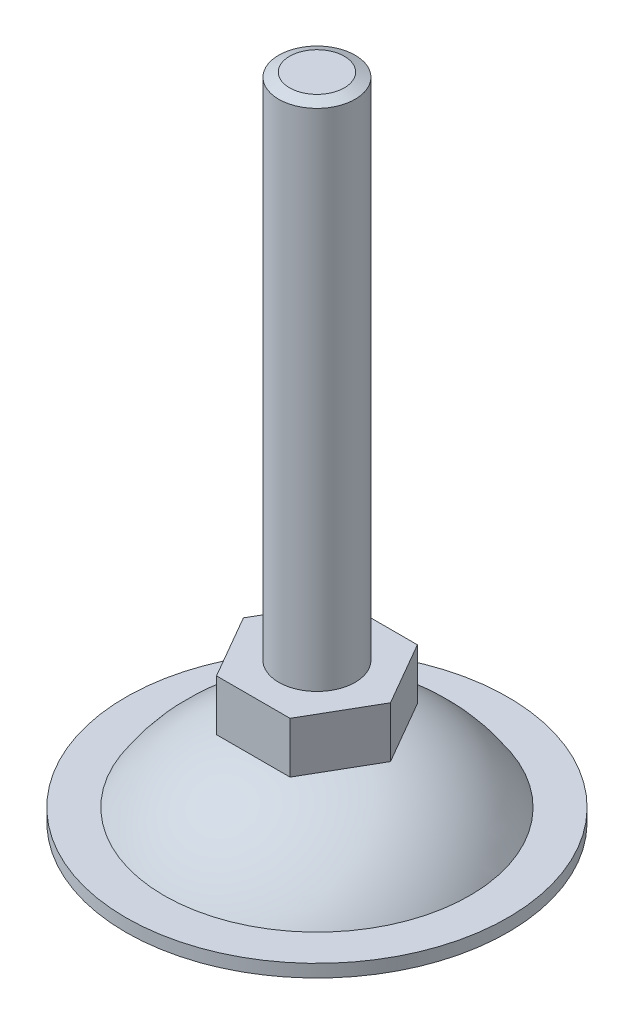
ISO-10303-21;
HEADER;
FILE_DESCRIPTION(('STEP AP214'),'2;1');
FILE_NAME('part.step','',(''),(''),'','','');
FILE_SCHEMA(('AUTOMOTIVE_DESIGN { 1 0 10303 214 1 1 1 1 }'));
ENDSEC;
DATA;
#1=APPLICATION_CONTEXT('core data for automotive mechanical design processes');
#2=APPLICATION_PROTOCOL_DEFINITION('international standard','automotive_design',2000,#1);
#3=PRODUCT_CONTEXT('',#1,'mechanical');
#4=PRODUCT('Part','Part','',(#3));
#5=PRODUCT_RELATED_PRODUCT_CATEGORY('part','',(#4));
#6=PRODUCT_DEFINITION_FORMATION('','',#4);
#7=PRODUCT_DEFINITION_CONTEXT('part definition',#1,'design');
#8=PRODUCT_DEFINITION('design','',#6,#7);
#9=PRODUCT_DEFINITION_SHAPE('','',#8);
#10=(LENGTH_UNIT() NAMED_UNIT(*) SI_UNIT(.MILLI.,.METRE.));
#11=(NAMED_UNIT(*) PLANE_ANGLE_UNIT() SI_UNIT($,.RADIAN.));
#12=(NAMED_UNIT(*) SI_UNIT($,.STERADIAN.) SOLID_ANGLE_UNIT());
#13=UNCERTAINTY_MEASURE_WITH_UNIT(LENGTH_MEASURE(1.E-05),#10,'distance_accuracy_value','');
#14=(GEOMETRIC_REPRESENTATION_CONTEXT(3) GLOBAL_UNCERTAINTY_ASSIGNED_CONTEXT((#13)) GLOBAL_UNIT_ASSIGNED_CONTEXT((#10,
#11,#12)) REPRESENTATION_CONTEXT('',''));
#15=CARTESIAN_POINT('',(0.,0.,0.));
#16=DIRECTION('',(0.,0.,1.));
#17=DIRECTION('',(1.,0.,0.));
#18=AXIS2_PLACEMENT_3D('',#15,#16,#17);
#19=CARTESIAN_POINT('',(0.,51.,0.));
#20=DIRECTION('',(0.,1.,0.));
#21=DIRECTION('',(0.,0.,1.));
#22=AXIS2_PLACEMENT_3D('',#19,#20,#21);
#23=CYLINDRICAL_SURFACE('',#22,3.);
#24=CARTESIAN_POINT('',(0.,6.90262048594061,0.));
#25=DIRECTION('',(0.,1.,0.));
#26=DIRECTION('',(0.,0.,1.));
#27=AXIS2_PLACEMENT_3D('',#24,#25,#26);
#28=CIRCLE('',#27,3.00000000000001);
#29=CARTESIAN_POINT('',(0.,6.90262048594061,3.00000000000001));
#30=VERTEX_POINT('',#29);
#31=EDGE_CURVE('E155',#30,#30,#28,.T.);
#32=ORIENTED_EDGE('',*,*,#31,.T.);
#33=EDGE_LOOP('',(#32));
#34=FACE_BOUND('',#33,.T.);
#35=CARTESIAN_POINT('',(0.,6.99999999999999,0.));
#36=DIRECTION('',(0.,1.,0.));
#37=DIRECTION('',(0.,0.,1.));
#38=AXIS2_PLACEMENT_3D('',#35,#36,#37);
#39=CIRCLE('',#38,3.);
#40=CARTESIAN_POINT('',(0.,6.99999999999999,3.));
#41=VERTEX_POINT('',#40);
#42=EDGE_CURVE('E11',#41,#41,#39,.T.);
#43=ORIENTED_EDGE('',*,*,#42,.F.);
#44=EDGE_LOOP('',(#43));
#45=FACE_BOUND('',#44,.T.);
#46=ADVANCED_FACE('F37',(#34,#45),#23,.T.);
#47=CARTESIAN_POINT('',(0.,0.,0.));
#48=DIRECTION('',(0.,1.,0.));
#49=DIRECTION('',(0.,0.,1.));
#50=AXIS2_PLACEMENT_3D('',#47,#48,#49);
#51=PLANE('',#50);
#52=CARTESIAN_POINT('',(0.,0.,0.));
#53=DIRECTION('',(0.,1.,0.));
#54=DIRECTION('',(0.,0.,1.));
#55=AXIS2_PLACEMENT_3D('',#52,#53,#54);
#56=CIRCLE('',#55,15.);
#57=CARTESIAN_POINT('',(0.,0.,15.));
#58=VERTEX_POINT('',#57);
#59=EDGE_CURVE('E47',#58,#58,#56,.T.);
#60=ORIENTED_EDGE('',*,*,#59,.F.);
#61=EDGE_LOOP('',(#60));
#62=FACE_BOUND('',#61,.T.);
#63=ADVANCED_FACE('F169',(#62),#51,.F.);
#64=CARTESIAN_POINT('',(0.,51.,0.));
#65=DIRECTION('',(0.,1.,0.));
#66=DIRECTION('',(0.,0.,1.));
#67=AXIS2_PLACEMENT_3D('',#64,#65,#66);
#68=CYLINDRICAL_SURFACE('',#67,15.);
#69=CARTESIAN_POINT('',(0.,0.999999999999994,0.));
#70=DIRECTION('',(0.,1.,0.));
#71=DIRECTION('',(0.,0.,1.));
#72=AXIS2_PLACEMENT_3D('',#69,#70,#71);
#73=CIRCLE('',#72,15.);
#74=CARTESIAN_POINT('',(0.,0.999999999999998,15.));
#75=VERTEX_POINT('',#74);
#76=EDGE_CURVE('E161',#75,#75,#73,.T.);
#77=ORIENTED_EDGE('',*,*,#76,.F.);
#78=EDGE_LOOP('',(#77));
#79=FACE_BOUND('',#78,.T.);
#80=ORIENTED_EDGE('',*,*,#59,.T.);
#81=EDGE_LOOP('',(#80));
#82=FACE_BOUND('',#81,.T.);
#83=ADVANCED_FACE('F167',(#79,#82),#68,.T.);
#84=CARTESIAN_POINT('',(0.,1.00000000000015,-12.));
#85=DIRECTION('',(0.,-1.,0.));
#86=DIRECTION('',(0.,0.,-1.));
#87=AXIS2_PLACEMENT_3D('',#84,#85,#86);
#88=PLANE('',#87);
#89=CARTESIAN_POINT('',(0.,1.00000000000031,0.));
#90=DIRECTION('',(0.,1.,0.));
#91=DIRECTION('',(0.,0.,1.));
#92=AXIS2_PLACEMENT_3D('',#89,#90,#91);
#93=CIRCLE('',#92,12.);
#94=CARTESIAN_POINT('',(0.,1.00000000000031,12.));
#95=VERTEX_POINT('',#94);
#96=EDGE_CURVE('E158',#95,#95,#93,.T.);
#97=ORIENTED_EDGE('',*,*,#96,.F.);
#98=EDGE_LOOP('',(#97));
#99=FACE_BOUND('',#98,.T.);
#100=ORIENTED_EDGE('',*,*,#76,.T.);
#101=EDGE_LOOP('',(#100));
#102=FACE_BOUND('',#101,.T.);
#103=ADVANCED_FACE('F175',(#99,#102),#88,.F.);
#104=CARTESIAN_POINT('',(0.,-5.82974175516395,0.));
#105=DIRECTION('',(0.,1.,0.));
#106=DIRECTION('',(0.,0.,1.));
#107=AXIS2_PLACEMENT_3D('',#104,#105,#106);
#108=DEGENERATE_TOROIDAL_SURFACE('',#107,1.08512912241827,12.8755496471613,.T.);
#109=ORIENTED_EDGE('',*,*,#31,.F.);
#110=EDGE_LOOP('',(#109));
#111=FACE_BOUND('',#110,.T.);
#112=ORIENTED_EDGE('',*,*,#96,.T.);
#113=EDGE_LOOP('',(#112));
#114=FACE_BOUND('',#113,.T.);
#115=ADVANCED_FACE('F184',(#111,#114),#108,.T.);
#116=CARTESIAN_POINT('',(2.88675134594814,11.,-5.00000000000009));
#117=DIRECTION('',(0.,1.,0.));
#118=DIRECTION('',(0.,0.,1.));
#119=AXIS2_PLACEMENT_3D('',#116,#117,#118);
#120=PLANE('',#119);
#121=DIRECTION('',(1.,0.,0.));
#122=VECTOR('',#121,1.);
#123=CARTESIAN_POINT('',(2.88675134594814,11.,-5.00000000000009));
#124=LINE('',#123,#122);
#125=CARTESIAN_POINT('',(-2.88675134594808,11.,-5.00000000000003));
#126=VERTEX_POINT('',#125);
#127=CARTESIAN_POINT('',(2.88675134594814,11.,-5.00000000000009));
#128=VERTEX_POINT('',#127);
#129=EDGE_CURVE('E142',#126,#128,#124,.T.);
#130=ORIENTED_EDGE('',*,*,#129,.F.);
#131=DIRECTION('',(0.500000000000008,0.,-0.866025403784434));
#132=VECTOR('',#131,1.);
#133=CARTESIAN_POINT('',(-2.88675134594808,11.,-5.00000000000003));
#134=LINE('',#133,#132);
#135=CARTESIAN_POINT('',(-5.77350269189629,11.,0.));
#136=VERTEX_POINT('',#135);
#137=EDGE_CURVE('E117',#136,#126,#134,.T.);
#138=ORIENTED_EDGE('',*,*,#137,.F.);
#139=DIRECTION('',(-0.500000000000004,0.,-0.866025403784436));
#140=VECTOR('',#139,1.);
#141=CARTESIAN_POINT('',(-5.77350269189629,11.,0.));
#142=LINE('',#141,#140);
#143=CARTESIAN_POINT('',(-2.88675134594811,11.,5.00000000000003));
#144=VERTEX_POINT('',#143);
#145=EDGE_CURVE('E101',#144,#136,#142,.T.);
#146=ORIENTED_EDGE('',*,*,#145,.F.);
#147=DIRECTION('',(-1.,0.,0.));
#148=VECTOR('',#147,1.);
#149=CARTESIAN_POINT('',(2.88675134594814,11.,5.00000000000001));
#150=LINE('',#149,#148);
#151=CARTESIAN_POINT('',(2.88675134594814,11.,5.00000000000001));
#152=VERTEX_POINT('',#151);
#153=EDGE_CURVE('E115',#152,#144,#150,.T.);
#154=ORIENTED_EDGE('',*,*,#153,.F.);
#155=DIRECTION('',(-0.499999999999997,0.,0.86602540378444));
#156=VECTOR('',#155,1.);
#157=CARTESIAN_POINT('',(5.77350269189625,11.,0.));
#158=LINE('',#157,#156);
#159=CARTESIAN_POINT('',(5.77350269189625,11.,0.));
#160=VERTEX_POINT('',#159);
#161=EDGE_CURVE('E120',#160,#152,#158,.T.);
#162=ORIENTED_EDGE('',*,*,#161,.F.);
#163=DIRECTION('',(0.499999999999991,0.,0.866025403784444));
#164=VECTOR('',#163,1.);
#165=CARTESIAN_POINT('',(2.88675134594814,11.,-5.00000000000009));
#166=LINE('',#165,#164);
#167=EDGE_CURVE('E122',#128,#160,#166,.T.);
#168=ORIENTED_EDGE('',*,*,#167,.F.);
#169=EDGE_LOOP('',(#130,#138,#146,#154,#162,#168));
#170=FACE_BOUND('',#169,.T.);
#171=CARTESIAN_POINT('',(0.,11.,0.));
#172=DIRECTION('',(0.,1.,0.));
#173=DIRECTION('',(0.,0.,1.));
#174=AXIS2_PLACEMENT_3D('',#171,#172,#173);
#175=CIRCLE('',#174,3.);
#176=CARTESIAN_POINT('',(0.,11.,3.));
#177=VERTEX_POINT('',#176);
#178=EDGE_CURVE('E41',#177,#177,#175,.T.);
#179=ORIENTED_EDGE('',*,*,#178,.F.);
#180=EDGE_LOOP('',(#179));
#181=FACE_BOUND('',#180,.T.);
#182=ADVANCED_FACE('F112',(#170,#181),#120,.T.);
#183=CARTESIAN_POINT('',(2.88675134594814,7.,-5.00000000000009));
#184=DIRECTION('',(0.,1.,0.));
#185=DIRECTION('',(0.,0.,1.));
#186=AXIS2_PLACEMENT_3D('',#183,#184,#185);
#187=PLANE('',#186);
#188=DIRECTION('',(1.,0.,0.));
#189=VECTOR('',#188,1.);
#190=CARTESIAN_POINT('',(2.88675134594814,7.,-5.00000000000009));
#191=LINE('',#190,#189);
#192=CARTESIAN_POINT('',(-2.88675134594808,7.,-5.00000000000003));
#193=VERTEX_POINT('',#192);
#194=CARTESIAN_POINT('',(2.88675134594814,7.,-5.00000000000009));
#195=VERTEX_POINT('',#194);
#196=EDGE_CURVE('E127',#193,#195,#191,.T.);
#197=ORIENTED_EDGE('',*,*,#196,.T.);
#198=DIRECTION('',(0.499999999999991,0.,0.866025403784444));
#199=VECTOR('',#198,1.);
#200=CARTESIAN_POINT('',(2.88675134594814,7.,-5.00000000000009));
#201=LINE('',#200,#199);
#202=CARTESIAN_POINT('',(5.77350269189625,6.99999999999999,0.));
#203=VERTEX_POINT('',#202);
#204=EDGE_CURVE('E130',#195,#203,#201,.T.);
#205=ORIENTED_EDGE('',*,*,#204,.T.);
#206=DIRECTION('',(-0.499999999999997,0.,0.86602540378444));
#207=VECTOR('',#206,1.);
#208=CARTESIAN_POINT('',(5.77350269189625,6.99999999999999,0.));
#209=LINE('',#208,#207);
#210=CARTESIAN_POINT('',(2.88675134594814,6.99999999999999,5.));
#211=VERTEX_POINT('',#210);
#212=EDGE_CURVE('E133',#203,#211,#209,.T.);
#213=ORIENTED_EDGE('',*,*,#212,.T.);
#214=DIRECTION('',(-1.,0.,0.));
#215=VECTOR('',#214,1.);
#216=CARTESIAN_POINT('',(2.88675134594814,6.99999999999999,5.));
#217=LINE('',#216,#215);
#218=CARTESIAN_POINT('',(-2.88675134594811,6.99999999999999,5.00000000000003));
#219=VERTEX_POINT('',#218);
#220=EDGE_CURVE('E136',#211,#219,#217,.T.);
#221=ORIENTED_EDGE('',*,*,#220,.T.);
#222=DIRECTION('',(-0.500000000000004,0.,-0.866025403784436));
#223=VECTOR('',#222,1.);
#224=CARTESIAN_POINT('',(-5.77350269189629,6.99999999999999,0.));
#225=LINE('',#224,#223);
#226=CARTESIAN_POINT('',(-5.77350269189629,6.99999999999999,0.));
#227=VERTEX_POINT('',#226);
#228=EDGE_CURVE('E103',#219,#227,#225,.T.);
#229=ORIENTED_EDGE('',*,*,#228,.T.);
#230=DIRECTION('',(0.500000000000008,0.,-0.866025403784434));
#231=VECTOR('',#230,1.);
#232=CARTESIAN_POINT('',(-2.88675134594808,7.,-5.00000000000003));
#233=LINE('',#232,#231);
#234=EDGE_CURVE('E139',#227,#193,#233,.T.);
#235=ORIENTED_EDGE('',*,*,#234,.T.);
#236=EDGE_LOOP('',(#197,#205,#213,#221,#229,#235));
#237=FACE_BOUND('',#236,.T.);
#238=ORIENTED_EDGE('',*,*,#42,.T.);
#239=EDGE_LOOP('',(#238));
#240=FACE_BOUND('',#239,.T.);
#241=ADVANCED_FACE('F199',(#237,#240),#187,.F.);
#242=CARTESIAN_POINT('',(2.88675134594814,11.,-5.00000000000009));
#243=DIRECTION('',(0.,0.,-1.));
#244=DIRECTION('',(-1.,0.,0.));
#245=AXIS2_PLACEMENT_3D('',#242,#243,#244);
#246=PLANE('',#245);
#247=ORIENTED_EDGE('',*,*,#196,.F.);
#248=DIRECTION('',(0.,-1.,0.));
#249=VECTOR('',#248,1.);
#250=CARTESIAN_POINT('',(-2.88675134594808,11.,-5.00000000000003));
#251=LINE('',#250,#249);
#252=EDGE_CURVE('E55',#126,#193,#251,.T.);
#253=ORIENTED_EDGE('',*,*,#252,.F.);
#254=ORIENTED_EDGE('',*,*,#129,.T.);
#255=DIRECTION('',(0.,-1.,0.));
#256=VECTOR('',#255,1.);
#257=CARTESIAN_POINT('',(2.88675134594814,11.,-5.00000000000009));
#258=LINE('',#257,#256);
#259=EDGE_CURVE('E90',#128,#195,#258,.T.);
#260=ORIENTED_EDGE('',*,*,#259,.T.);
#261=EDGE_LOOP('',(#247,#253,#254,#260));
#262=FACE_BOUND('',#261,.T.);
#263=ADVANCED_FACE('F195',(#262),#246,.T.);
#264=CARTESIAN_POINT('',(-2.88675134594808,11.,-5.00000000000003));
#265=DIRECTION('',(-0.866025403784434,0.,-0.500000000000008));
#266=DIRECTION('',(-0.500000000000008,0.,0.866025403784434));
#267=AXIS2_PLACEMENT_3D('',#264,#265,#266);
#268=PLANE('',#267);
#269=ORIENTED_EDGE('',*,*,#234,.F.);
#270=DIRECTION('',(0.,-1.,0.));
#271=VECTOR('',#270,1.);
#272=CARTESIAN_POINT('',(-5.77350269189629,11.,0.));
#273=LINE('',#272,#271);
#274=EDGE_CURVE('E78',#136,#227,#273,.T.);
#275=ORIENTED_EDGE('',*,*,#274,.F.);
#276=ORIENTED_EDGE('',*,*,#137,.T.);
#277=ORIENTED_EDGE('',*,*,#252,.T.);
#278=EDGE_LOOP('',(#269,#275,#276,#277));
#279=FACE_BOUND('',#278,.T.);
#280=ADVANCED_FACE('F198',(#279),#268,.T.);
#281=CARTESIAN_POINT('',(-5.77350269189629,11.,0.));
#282=DIRECTION('',(-0.866025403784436,0.,0.500000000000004));
#283=DIRECTION('',(0.500000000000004,0.,0.866025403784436));
#284=AXIS2_PLACEMENT_3D('',#281,#282,#283);
#285=PLANE('',#284);
#286=ORIENTED_EDGE('',*,*,#228,.F.);
#287=DIRECTION('',(0.,-1.,0.));
#288=VECTOR('',#287,1.);
#289=CARTESIAN_POINT('',(-2.88675134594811,11.,5.00000000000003));
#290=LINE('',#289,#288);
#291=EDGE_CURVE('E98',#144,#219,#290,.T.);
#292=ORIENTED_EDGE('',*,*,#291,.F.);
#293=ORIENTED_EDGE('',*,*,#145,.T.);
#294=ORIENTED_EDGE('',*,*,#274,.T.);
#295=EDGE_LOOP('',(#286,#292,#293,#294));
#296=FACE_BOUND('',#295,.T.);
#297=ADVANCED_FACE('F100',(#296),#285,.T.);
#298=CARTESIAN_POINT('',(2.88675134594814,11.,5.00000000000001));
#299=DIRECTION('',(0.,0.,1.));
#300=DIRECTION('',(1.,0.,0.));
#301=AXIS2_PLACEMENT_3D('',#298,#299,#300);
#302=PLANE('',#301);
#303=ORIENTED_EDGE('',*,*,#220,.F.);
#304=DIRECTION('',(0.,-1.,0.));
#305=VECTOR('',#304,1.);
#306=CARTESIAN_POINT('',(2.88675134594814,11.,5.00000000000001));
#307=LINE('',#306,#305);
#308=EDGE_CURVE('E108',#152,#211,#307,.T.);
#309=ORIENTED_EDGE('',*,*,#308,.F.);
#310=ORIENTED_EDGE('',*,*,#153,.T.);
#311=ORIENTED_EDGE('',*,*,#291,.T.);
#312=EDGE_LOOP('',(#303,#309,#310,#311));
#313=FACE_BOUND('',#312,.T.);
#314=ADVANCED_FACE('F119',(#313),#302,.T.);
#315=CARTESIAN_POINT('',(5.77350269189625,11.,0.));
#316=DIRECTION('',(0.86602540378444,0.,0.499999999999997));
#317=DIRECTION('',(0.499999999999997,0.,-0.86602540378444));
#318=AXIS2_PLACEMENT_3D('',#315,#316,#317);
#319=PLANE('',#318);
#320=ORIENTED_EDGE('',*,*,#212,.F.);
#321=DIRECTION('',(0.,-1.,0.));
#322=VECTOR('',#321,1.);
#323=CARTESIAN_POINT('',(5.77350269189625,11.,0.));
#324=LINE('',#323,#322);
#325=EDGE_CURVE('E146',#160,#203,#324,.T.);
#326=ORIENTED_EDGE('',*,*,#325,.F.);
#327=ORIENTED_EDGE('',*,*,#161,.T.);
#328=ORIENTED_EDGE('',*,*,#308,.T.);
#329=EDGE_LOOP('',(#320,#326,#327,#328));
#330=FACE_BOUND('',#329,.T.);
#331=ADVANCED_FACE('F203',(#330),#319,.T.);
#332=CARTESIAN_POINT('',(2.88675134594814,11.,-5.00000000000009));
#333=DIRECTION('',(0.866025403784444,0.,-0.499999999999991));
#334=DIRECTION('',(-0.499999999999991,0.,-0.866025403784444));
#335=AXIS2_PLACEMENT_3D('',#332,#333,#334);
#336=PLANE('',#335);
#337=ORIENTED_EDGE('',*,*,#204,.F.);
#338=ORIENTED_EDGE('',*,*,#259,.F.);
#339=ORIENTED_EDGE('',*,*,#167,.T.);
#340=ORIENTED_EDGE('',*,*,#325,.T.);
#341=EDGE_LOOP('',(#337,#338,#339,#340));
#342=FACE_BOUND('',#341,.T.);
#343=ADVANCED_FACE('F200',(#342),#336,.T.);
#344=CARTESIAN_POINT('',(0.,51.,0.));
#345=DIRECTION('',(0.,-1.,0.));
#346=DIRECTION('',(0.,0.,-1.));
#347=AXIS2_PLACEMENT_3D('',#344,#345,#346);
#348=PLANE('',#347);
#349=CARTESIAN_POINT('',(0.,51.,0.));
#350=DIRECTION('',(0.,1.,0.));
#351=DIRECTION('',(0.,0.,1.));
#352=AXIS2_PLACEMENT_3D('',#349,#350,#351);
#353=CIRCLE('',#352,2.14999999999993);
#354=CARTESIAN_POINT('',(0.,51.,2.14999999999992));
#355=VERTEX_POINT('',#354);
#356=EDGE_CURVE('E149',#355,#355,#353,.T.);
#357=ORIENTED_EDGE('',*,*,#356,.T.);
#358=EDGE_LOOP('',(#357));
#359=FACE_BOUND('',#358,.T.);
#360=ADVANCED_FACE('F39',(#359),#348,.F.);
#361=CARTESIAN_POINT('',(0.,50.65,0.));
#362=DIRECTION('',(0.,-1.,0.));
#363=DIRECTION('',(0.,0.,-1.));
#364=AXIS2_PLACEMENT_3D('',#361,#362,#363);
#365=CONICAL_SURFACE('',#364,2.99999999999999,1.18018928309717);
#366=ORIENTED_EDGE('',*,*,#356,.F.);
#367=EDGE_LOOP('',(#366));
#368=FACE_BOUND('',#367,.T.);
#369=CARTESIAN_POINT('',(0.,50.65,0.));
#370=DIRECTION('',(0.,1.,0.));
#371=DIRECTION('',(0.,0.,1.));
#372=AXIS2_PLACEMENT_3D('',#369,#370,#371);
#373=CIRCLE('',#372,2.99999999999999);
#374=CARTESIAN_POINT('',(0.,50.65,2.99999999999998));
#375=VERTEX_POINT('',#374);
#376=EDGE_CURVE('E152',#375,#375,#373,.T.);
#377=ORIENTED_EDGE('',*,*,#376,.T.);
#378=EDGE_LOOP('',(#377));
#379=FACE_BOUND('',#378,.T.);
#380=ADVANCED_FACE('F190',(#368,#379),#365,.T.);
#381=ORIENTED_EDGE('',*,*,#178,.T.);
#382=EDGE_LOOP('',(#381));
#383=FACE_BOUND('',#382,.T.);
#384=ORIENTED_EDGE('',*,*,#376,.F.);
#385=EDGE_LOOP('',(#384));
#386=FACE_BOUND('',#385,.T.);
#387=ADVANCED_FACE('F180',(#383,#386),#23,.T.);
#388=CLOSED_SHELL('',(#46,#63,#83,#103,#115,#182,#241,#263,#280,#297,#314,#331,#343,#360,#380,#387));
#389=MANIFOLD_SOLID_BREP('B2',#388);
#390=ADVANCED_BREP_SHAPE_REPRESENTATION('',(#18,#389),#14);
#391=SHAPE_DEFINITION_REPRESENTATION(#9,#390);
ENDSEC;
END-ISO-10303-21;
